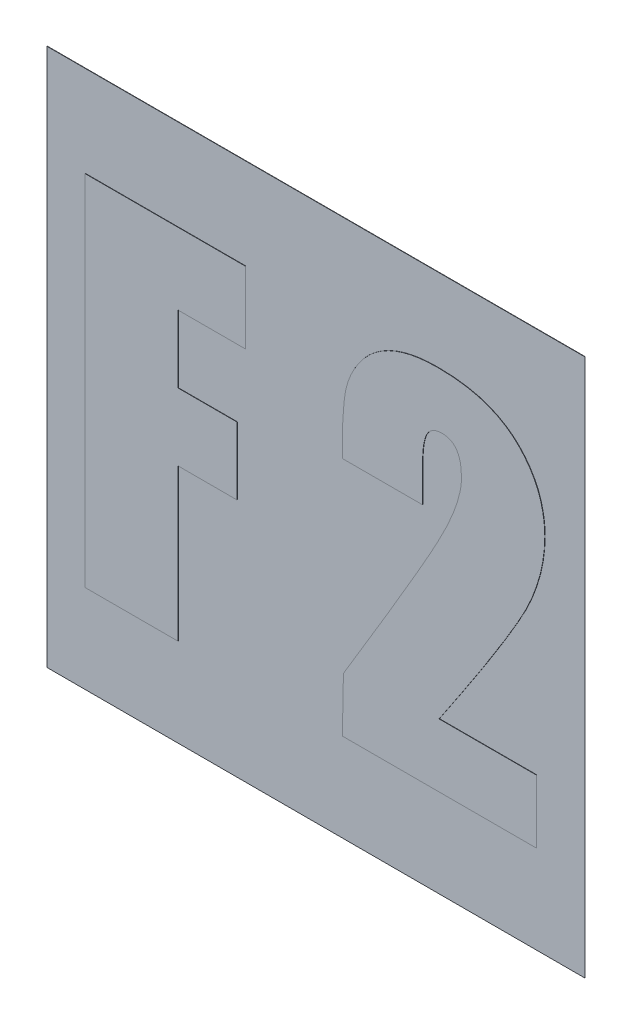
from build123d import *

# Parameters (mm, degrees)
SKETCH1_W           = 15
SKETCH1_H           = 15
BASE_EXTRUDE_DEPTH  = 0.01
BOSS_EXTRUDE1_DEPTH = 0.01


with BuildPart() as part:
    # Sketch1 → Base-Extrude (new body)
    with BuildSketch(Plane.XY):
        Rectangle(SKETCH1_W, SKETCH1_H)
    extrude(amount=BASE_EXTRUDE_DEPTH)

    # Sketch3 → Boss-Extrude1 (add)
    with BuildSketch(Plane.XY.offset(0.01)):
        Polygon((-6.422687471, 4.966697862), (-1.95437388, 4.966697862), (-1.95437388, 2.967715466), (-3.835769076, 2.967715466), (-3.835769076, 1.08632027), (-2.189548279, 1.08632027), (-2.189548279, -0.795074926), (-3.835769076, -0.795074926), (-3.835769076, -5.028214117), (-6.422687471, -5.028214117), align=None)
        with BuildLine():
            Line((6.159142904, -3.264406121), (6.159142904, -5.028214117))
            Line((6.159142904, -5.028214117), (0.750131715, -5.028214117))
            Line((0.750131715, -5.028214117), (0.779528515, -3.499580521))
            add(Edge.make_bspline(
                [(0.779528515, -3.499580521), (0.877014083, -3.338576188), (1.066979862, -3.024834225), (1.343045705, -2.56480754), (1.602681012, -2.128002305), (1.850432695, -1.716510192), (2.079193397, -1.326713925), (2.294345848, -0.961203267), (2.494671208, -0.619498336), (2.679973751, -0.301493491), (2.851966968, -0.007907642), (3.004887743, 0.263950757), (3.145640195, 0.510739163), (3.270514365, 0.733991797), (3.3786378, 0.934750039), (3.473207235, 1.111300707), (3.551330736, 1.264877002), (3.636598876, 1.434182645), (3.725717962, 1.624674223), (3.817352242, 1.840530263), (3.894914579, 2.044060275), (3.960461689, 2.233412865), (4.006982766, 2.411483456), (4.046334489, 2.574975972), (4.066429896, 2.727136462), (4.070191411, 2.824363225), (4.071970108, 2.870338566)],
                knots=[0, 0, 0, 0, 1.878632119, 3.660806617, 5.354925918, 6.950497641, 8.454906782, 9.866025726, 11.183856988, 12.408403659, 13.539669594, 14.579925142, 15.521615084, 16.375397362, 17.133040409, 17.797539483, 18.374382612, 18.852785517, 19.689593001, 20.472986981, 21.192742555, 21.863510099, 22.471481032, 23.029088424, 23.540887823, 24, 24, 24, 24], degree=3))
            add(Edge.make_bspline(
                [(4.071970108, 2.870338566), (4.070068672, 2.933484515), (4.066508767, 3.051707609), (4.04433705, 3.217001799), (4.002738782, 3.357003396), (3.943565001, 3.472371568), (3.867169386, 3.564598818), (3.769499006, 3.629208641), (3.653793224, 3.66631058), (3.571275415, 3.67085994), (3.528129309, 3.673238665)],
                knots=[0, 0, 0, 0, 1.376412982, 2.576947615, 3.62402596, 4.543455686, 5.386042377, 6.20416995, 7.061013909, 8, 8, 8, 8], degree=3))
            add(Edge.make_bspline(
                [(3.528129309, 3.673238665), (3.484910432, 3.671163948), (3.401853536, 3.667176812), (3.285749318, 3.625396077), (3.188411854, 3.554676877), (3.125112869, 3.473103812), (3.084579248, 3.393226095), (3.05651705, 3.3188966), (3.036714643, 3.230759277), (3.014954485, 3.130743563), (3.000980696, 3.016402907), (2.993317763, 2.888767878), (2.984453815, 2.747962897), (2.984345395, 2.649879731), (2.98428851, 2.598418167)],
                knots=[0, 0, 0, 0, 1.138253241, 2.187465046, 3.206937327, 4.278370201, 4.878997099, 5.57020963, 6.370754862, 7.262421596, 8.273901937, 9.409391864, 10.640778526, 12, 12, 12, 12], degree=3))
            Line((2.98428851, 2.598418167), (2.98428851, 1.674256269))
            Line((2.98428851, 1.674256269), (0.750131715, 1.674256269))
            Line((0.750131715, 1.674256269), (0.750131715, 2.032529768))
            add(Edge.make_bspline(
                [(0.750131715, 2.032529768), (0.751022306, 2.16238688), (0.752707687, 2.408132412), (0.769457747, 2.75497652), (0.794121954, 3.058519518), (0.829016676, 3.326551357), (0.8889659, 3.572609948), (0.980977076, 3.808592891), (1.100992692, 4.043964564), (1.252566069, 4.272463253), (1.429507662, 4.48928336), (1.638168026, 4.678306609), (1.871509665, 4.838617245), (2.129530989, 4.972884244), (2.414907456, 5.074410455), (2.724975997, 5.15020006), (3.062040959, 5.194068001), (3.295275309, 5.19920968), (3.416054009, 5.201872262)],
                knots=[0, 0, 0, 0, 1.302330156, 2.46456904, 3.481715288, 4.3564703, 5.172861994, 6.014736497, 6.891064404, 7.817842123, 8.760022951, 9.690518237, 10.631035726, 11.592579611, 12.599117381, 13.66133539, 14.788939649, 16, 16, 16, 16], degree=3))
            add(Edge.make_bspline(
                [(3.416054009, 5.201872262), (3.534966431, 5.200080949), (3.765988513, 5.196600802), (4.101222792, 5.160428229), (4.414479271, 5.105247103), (4.705518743, 5.023904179), (4.974089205, 4.91969881), (5.220309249, 4.792782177), (5.443526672, 4.64230899), (5.643566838, 4.469806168), (5.819026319, 4.278351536), (5.973160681, 4.074852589), (6.103805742, 3.859461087), (6.211974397, 3.632193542), (6.292222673, 3.39113189), (6.350412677, 3.138911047), (6.389348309, 2.874602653), (6.392639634, 2.69409963), (6.394317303, 2.602092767)],
                knots=[0, 0, 0, 0, 1.276486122, 2.479946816, 3.616419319, 4.68874101, 5.719519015, 6.704924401, 7.657090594, 8.60369864, 9.534525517, 10.440795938, 11.340864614, 12.235220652, 13.137832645, 14.063090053, 15.012709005, 16, 16, 16, 16], degree=3))
            add(Edge.make_bspline(
                [(6.394317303, 2.602092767), (6.392746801, 2.530392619), (6.389573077, 2.385498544), (6.368416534, 2.166525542), (6.335496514, 1.944494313), (6.289237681, 1.718691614), (6.228852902, 1.490592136), (6.154009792, 1.259261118), (6.068593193, 1.024462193), (5.983251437, 0.825045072), (5.903440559, 0.656268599), (5.831206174, 0.511348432), (5.744678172, 0.350644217), (5.645434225, 0.172419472), (5.533178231, -0.022253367), (5.408235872, -0.23355711), (5.269714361, -0.461563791), (5.12022609, -0.707268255), (4.955268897, -0.968500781), (4.779876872, -1.248181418), (4.588522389, -1.542420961), (4.386080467, -1.854729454), (4.169155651, -2.182111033), (3.941284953, -2.528915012), (3.699482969, -2.89155892), (3.532558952, -3.138340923), (3.447288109, -3.264406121)],
                knots=[0, 0, 0, 0, 0.776012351, 1.568191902, 2.379092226, 3.204599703, 4.061576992, 4.93155591, 5.835421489, 6.765002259, 7.277989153, 7.856056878, 8.51736844, 9.253274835, 10.063958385, 10.949555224, 11.910169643, 12.951531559, 14.062409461, 15.254103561, 16.524621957, 17.861273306, 19.282432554, 20.775291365, 22.352701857, 24, 24, 24, 24], degree=3))
            Line((3.447288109, -3.264406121), (6.159142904, -3.264406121))
        make_face()
    extrude(amount=BOSS_EXTRUDE1_DEPTH)


solid = part.part
